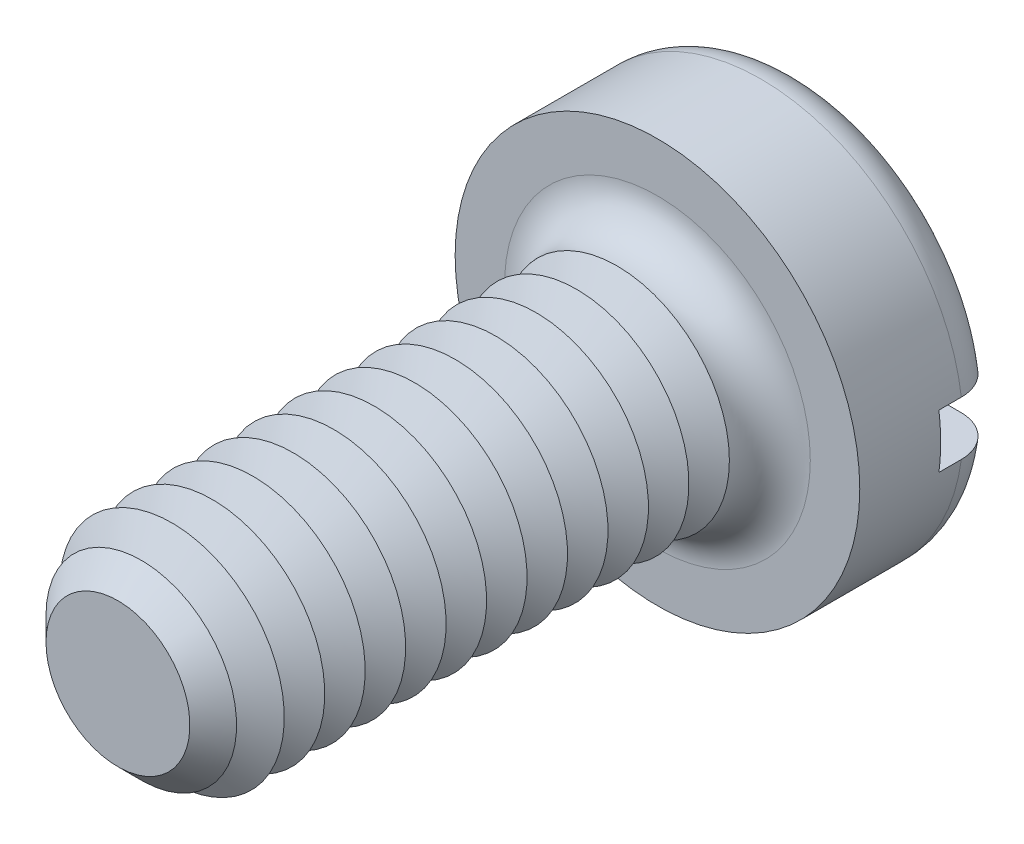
ISO-10303-21;
HEADER;
FILE_DESCRIPTION(('STEP AP214'),'2;1');
FILE_NAME('part.step','',(''),(''),'','','');
FILE_SCHEMA(('AUTOMOTIVE_DESIGN { 1 0 10303 214 1 1 1 1 }'));
ENDSEC;
DATA;
#1=APPLICATION_CONTEXT('core data for automotive mechanical design processes');
#2=APPLICATION_PROTOCOL_DEFINITION('international standard','automotive_design',2000,#1);
#3=PRODUCT_CONTEXT('',#1,'mechanical');
#4=PRODUCT('Part','Part','',(#3));
#5=PRODUCT_RELATED_PRODUCT_CATEGORY('part','',(#4));
#6=PRODUCT_DEFINITION_FORMATION('','',#4);
#7=PRODUCT_DEFINITION_CONTEXT('part definition',#1,'design');
#8=PRODUCT_DEFINITION('design','',#6,#7);
#9=PRODUCT_DEFINITION_SHAPE('','',#8);
#10=(LENGTH_UNIT() NAMED_UNIT(*) SI_UNIT(.MILLI.,.METRE.));
#11=(NAMED_UNIT(*) PLANE_ANGLE_UNIT() SI_UNIT($,.RADIAN.));
#12=(NAMED_UNIT(*) SI_UNIT($,.STERADIAN.) SOLID_ANGLE_UNIT());
#13=UNCERTAINTY_MEASURE_WITH_UNIT(LENGTH_MEASURE(1.E-05),#10,'distance_accuracy_value','');
#14=(GEOMETRIC_REPRESENTATION_CONTEXT(3) GLOBAL_UNCERTAINTY_ASSIGNED_CONTEXT((#13)) GLOBAL_UNIT_ASSIGNED_CONTEXT((#10,
#11,#12)) REPRESENTATION_CONTEXT('',''));
#15=CARTESIAN_POINT('',(0.,0.,0.));
#16=DIRECTION('',(0.,0.,1.));
#17=DIRECTION('',(1.,0.,0.));
#18=AXIS2_PLACEMENT_3D('',#15,#16,#17);
#19=CARTESIAN_POINT('',(0.,0.,-1.6));
#20=DIRECTION('',(0.,0.,1.));
#21=DIRECTION('',(1.,0.,0.));
#22=AXIS2_PLACEMENT_3D('',#19,#20,#21);
#23=PLANE('',#22);
#24=CARTESIAN_POINT('',(0.,0.,-1.6));
#25=DIRECTION('',(0.,0.,1.));
#26=DIRECTION('',(1.,0.,0.));
#27=AXIS2_PLACEMENT_3D('',#24,#25,#26);
#28=CIRCLE('',#27,1.8);
#29=CARTESIAN_POINT('',(-1.77482393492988,0.3,-1.6));
#30=VERTEX_POINT('',#29);
#31=CARTESIAN_POINT('',(1.77482393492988,0.3,-1.6));
#32=VERTEX_POINT('',#31);
#33=EDGE_CURVE('E116',#30,#32,#28,.F.);
#34=ORIENTED_EDGE('',*,*,#33,.T.);
#35=DIRECTION('',(1.,0.,0.));
#36=VECTOR('',#35,1.);
#37=CARTESIAN_POINT('',(-2.25,0.3,-1.6));
#38=LINE('',#37,#36);
#39=EDGE_CURVE('E111',#30,#32,#38,.T.);
#40=ORIENTED_EDGE('',*,*,#39,.F.);
#41=EDGE_LOOP('',(#34,#40));
#42=FACE_BOUND('',#41,.T.);
#43=ADVANCED_FACE('F39',(#42),#23,.F.);
#44=CARTESIAN_POINT('',(0.,0.,-1.15));
#45=DIRECTION('',(0.,0.,1.));
#46=DIRECTION('',(1.,0.,0.));
#47=AXIS2_PLACEMENT_3D('',#44,#45,#46);
#48=TOROIDAL_SURFACE('',#47,1.8,0.45);
#49=CARTESIAN_POINT('',(-2.09367249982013,0.3,-1.4713087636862));
#50=CARTESIAN_POINT('',(-2.07531034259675,0.3,-1.48912990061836));
#51=CARTESIAN_POINT('',(-2.05541605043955,0.3,-1.50540110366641));
#52=CARTESIAN_POINT('',(-2.01315405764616,0.3,-1.53437465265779));
#53=CARTESIAN_POINT('',(-1.99078310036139,0.3,-1.54707221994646));
#54=CARTESIAN_POINT('',(-1.94425163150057,0.3,-1.56853090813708));
#55=CARTESIAN_POINT('',(-1.92009286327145,0.3,-1.57729580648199));
#56=CARTESIAN_POINT('',(-1.8706617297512,0.3,-1.59068015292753));
#57=CARTESIAN_POINT('',(-1.84538964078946,0.3,-1.59530062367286));
#58=CARTESIAN_POINT('',(-1.7942134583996,0.3,-1.60031507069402));
#59=CARTESIAN_POINT('',(-1.76830582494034,0.3,-1.60067291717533));
#60=CARTESIAN_POINT('',(-1.71679040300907,0.3,-1.59707477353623));
#61=CARTESIAN_POINT('',(-1.69118264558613,0.3,-1.59311834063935));
#62=CARTESIAN_POINT('',(-1.64075792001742,0.3,-1.58095464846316));
#63=CARTESIAN_POINT('',(-1.61594989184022,0.3,-1.57271029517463));
#64=CARTESIAN_POINT('',(-1.56806655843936,0.3,-1.55217762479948));
#65=CARTESIAN_POINT('',(-1.54499130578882,0.3,-1.53988918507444));
#66=CARTESIAN_POINT('',(-1.50122413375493,0.3,-1.51158963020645));
#67=CARTESIAN_POINT('',(-1.48053389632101,0.3,-1.49557591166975));
#68=CARTESIAN_POINT('',(-1.44217532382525,0.3,-1.46026359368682));
#69=CARTESIAN_POINT('',(-1.42450683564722,0.3,-1.4409651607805));
#70=CARTESIAN_POINT('',(-1.39293961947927,0.3,-1.39986821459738));
#71=CARTESIAN_POINT('',(-1.37899788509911,0.3,-1.37810275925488));
#72=CARTESIAN_POINT('',(-1.35506190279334,0.3,-1.33249939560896));
#73=CARTESIAN_POINT('',(-1.34506709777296,0.3,-1.30866178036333));
#74=CARTESIAN_POINT('',(-1.3295415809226,0.3,-1.26015137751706));
#75=CARTESIAN_POINT('',(-1.32391771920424,0.3,-1.23550839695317));
#76=CARTESIAN_POINT('',(-1.31696995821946,0.3,-1.18562442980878));
#77=CARTESIAN_POINT('',(-1.31564552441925,0.3,-1.16038351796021));
#78=CARTESIAN_POINT('',(-1.31732714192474,0.3,-1.11049178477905));
#79=CARTESIAN_POINT('',(-1.32025766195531,0.3,-1.08583837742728));
#80=CARTESIAN_POINT('',(-1.3302124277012,0.3,-1.03737369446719));
#81=CARTESIAN_POINT('',(-1.33723664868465,0.3,-1.01356241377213));
#82=CARTESIAN_POINT('',(-1.35515820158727,0.3,-0.967413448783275));
#83=CARTESIAN_POINT('',(-1.36606032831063,0.3,-0.945077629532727));
#84=CARTESIAN_POINT('',(-1.39139351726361,0.3,-0.902507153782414));
#85=CARTESIAN_POINT('',(-1.40582489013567,0.3,-0.882272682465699));
#86=CARTESIAN_POINT('',(-1.43808691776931,0.3,-0.844072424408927));
#87=CARTESIAN_POINT('',(-1.4559757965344,0.3,-0.826155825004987));
#88=CARTESIAN_POINT('',(-1.49445205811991,0.3,-0.793502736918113));
#89=CARTESIAN_POINT('',(-1.51503974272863,0.3,-0.778766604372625));
#90=CARTESIAN_POINT('',(-1.55880475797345,0.3,-0.752571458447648));
#91=CARTESIAN_POINT('',(-1.58202794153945,0.3,-0.741189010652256));
#92=CARTESIAN_POINT('',(-1.63004083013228,0.3,-0.722432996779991));
#93=CARTESIAN_POINT('',(-1.65483064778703,0.3,-0.715059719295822));
#94=CARTESIAN_POINT('',(-1.70558060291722,0.3,-0.704463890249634));
#95=CARTESIAN_POINT('',(-1.73155090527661,0.3,-0.701289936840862));
#96=CARTESIAN_POINT('',(-1.78365633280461,0.3,-0.699350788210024));
#97=CARTESIAN_POINT('',(-1.80979145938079,0.3,-0.700585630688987));
#98=CARTESIAN_POINT('',(-1.86145503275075,0.3,-0.70744393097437));
#99=CARTESIAN_POINT('',(-1.88698403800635,0.3,-0.713063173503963));
#100=CARTESIAN_POINT('',(-1.93672112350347,0.3,-0.728546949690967));
#101=CARTESIAN_POINT('',(-1.96092925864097,0.3,-0.738411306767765));
#102=CARTESIAN_POINT('',(-2.00710191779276,0.3,-0.762015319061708));
#103=CARTESIAN_POINT('',(-2.02908465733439,0.3,-0.775719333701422));
#104=CARTESIAN_POINT('',(-2.0704025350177,0.3,-0.806663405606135));
#105=CARTESIAN_POINT('',(-2.08973782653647,0.3,-0.823903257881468));
#106=CARTESIAN_POINT('',(-2.12497879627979,0.3,-0.861218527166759));
#107=CARTESIAN_POINT('',(-2.1409209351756,0.3,-0.881259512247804));
#108=CARTESIAN_POINT('',(-2.16917502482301,0.3,-0.92375535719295));
#109=CARTESIAN_POINT('',(-2.18148717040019,0.3,-0.946210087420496));
#110=CARTESIAN_POINT('',(-2.20201023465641,0.3,-0.99266079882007));
#111=CARTESIAN_POINT('',(-2.21025973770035,0.3,-1.01663973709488));
#112=CARTESIAN_POINT('',(-2.22258852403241,0.3,-1.06564563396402));
#113=CARTESIAN_POINT('',(-2.22666813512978,0.3,-1.0906725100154));
#114=CARTESIAN_POINT('',(-2.23052418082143,0.3,-1.14090288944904));
#115=CARTESIAN_POINT('',(-2.23032644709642,0.3,-1.16610441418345));
#116=CARTESIAN_POINT('',(-2.22569614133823,0.3,-1.21612212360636));
#117=CARTESIAN_POINT('',(-2.2212625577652,0.3,-1.24093821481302));
#118=CARTESIAN_POINT('',(-2.20829785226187,0.3,-1.2894516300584));
#119=CARTESIAN_POINT('',(-2.19976997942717,0.3,-1.31314982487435));
#120=CARTESIAN_POINT('',(-2.17887390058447,0.3,-1.35876313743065));
#121=CARTESIAN_POINT('',(-2.1665103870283,0.3,-1.3806803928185));
#122=CARTESIAN_POINT('',(-2.14384463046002,0.3,-1.4140108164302));
#123=CARTESIAN_POINT('',(-2.13462949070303,0.3,-1.42617780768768));
#124=CARTESIAN_POINT('',(-2.1150151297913,0.3,-1.44951629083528));
#125=CARTESIAN_POINT('',(-2.10461591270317,0.3,-1.46068778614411));
#126=CARTESIAN_POINT('',(-2.09367249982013,0.3,-1.4713087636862));
#127=B_SPLINE_CURVE_WITH_KNOTS('',3,(#49,#50,#51,#52,#53,#54,#55,#56,#57,#58,#59,#60,#61,#62,
#63,#64,#65,#66,#67,#68,#69,#70,#71,#72,#73,#74,#75,#76,#77,#78,#79,#80,#81,#82,#83,#84,#85,#86,
#87,#88,#89,#90,#91,#92,#93,#94,#95,#96,#97,#98,#99,#100,#101,#102,#103,#104,#105,#106,#107,
#108,#109,#110,#111,#112,#113,#114,#115,#116,#117,#118,#119,#120,#121,#122,#123,#124,#125,#126),
.UNSPECIFIED.,.T.,.F.,(4,2,2,2,2,2,2,2,2,2,2,2,2,2,2,2,2,2,2,2,2,2,2,2,2,2,2,2,2,2,2,2,2,2,2,2,
2,2,4),(0.,0.0767085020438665,0.153519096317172,0.230255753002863,0.306973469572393,
0.384340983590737,0.461716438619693,0.539772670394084,0.617831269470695,0.695944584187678,
0.774053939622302,0.851218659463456,0.928372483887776,1.00383319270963,1.07928451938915,
1.15341274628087,1.22754052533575,1.30176027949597,1.37598656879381,1.45159320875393,
1.52720831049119,1.6044355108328,1.68166826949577,1.75978723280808,1.8379068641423,
1.91595148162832,1.99399285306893,2.07133254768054,2.14866775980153,2.22512456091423,
2.30157725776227,2.3772891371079,2.45299506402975,2.52824391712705,2.60351074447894,
2.67871794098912,2.75383349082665,2.79955010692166,2.84526656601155),.UNSPECIFIED.);
#128=CARTESIAN_POINT('',(-2.22991031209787,0.3,-1.14999999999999));
#129=VERTEX_POINT('',#128);
#130=EDGE_CURVE('E281',#129,#30,#127,.T.);
#131=ORIENTED_EDGE('',*,*,#130,.F.);
#132=CARTESIAN_POINT('',(0.,0.,-1.15));
#133=DIRECTION('',(0.,0.,1.));
#134=DIRECTION('',(1.,0.,0.));
#135=AXIS2_PLACEMENT_3D('',#132,#133,#134);
#136=CIRCLE('',#135,2.25);
#137=CARTESIAN_POINT('',(2.22991031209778,0.3,-1.15));
#138=VERTEX_POINT('',#137);
#139=EDGE_CURVE('E125',#138,#129,#136,.T.);
#140=ORIENTED_EDGE('',*,*,#139,.F.);
#141=CARTESIAN_POINT('',(1.39325818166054,0.3,-1.39903402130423));
#142=CARTESIAN_POINT('',(1.40771723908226,0.3,-1.42030595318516));
#143=CARTESIAN_POINT('',(1.4240122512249,0.3,-1.4403555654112));
#144=CARTESIAN_POINT('',(1.45976320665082,0.3,-1.4774406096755));
#145=CARTESIAN_POINT('',(1.47922380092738,0.3,-1.49447152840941));
#146=CARTESIAN_POINT('',(1.5206923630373,0.3,-1.52502510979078));
#147=CARTESIAN_POINT('',(1.54269721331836,0.3,-1.53855200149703));
#148=CARTESIAN_POINT('',(1.58863815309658,0.3,-1.56176272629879));
#149=CARTESIAN_POINT('',(1.61257369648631,0.3,-1.57144764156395));
#150=CARTESIAN_POINT('',(1.66199169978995,0.3,-1.58680804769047));
#151=CARTESIAN_POINT('',(1.68748839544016,0.3,-1.59243778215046));
#152=CARTESIAN_POINT('',(1.73906656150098,0.3,-1.59934902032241));
#153=CARTESIAN_POINT('',(1.76514807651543,0.3,-1.60063019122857));
#154=CARTESIAN_POINT('',(1.81721740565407,0.3,-1.59879130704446));
#155=CARTESIAN_POINT('',(1.84320486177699,0.3,-1.59566102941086));
#156=CARTESIAN_POINT('',(1.89427635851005,0.3,-1.58504931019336));
#157=CARTESIAN_POINT('',(1.91936042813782,0.3,-1.57756800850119));
#158=CARTESIAN_POINT('',(1.9677137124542,0.3,-1.55851722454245));
#159=CARTESIAN_POINT('',(1.99099484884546,0.3,-1.5469780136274));
#160=CARTESIAN_POINT('',(2.03525897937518,0.3,-1.52011224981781));
#161=CARTESIAN_POINT('',(2.05624211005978,0.3,-1.50478592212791));
#162=CARTESIAN_POINT('',(2.09506403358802,0.3,-1.47096472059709));
#163=CARTESIAN_POINT('',(2.11293536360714,0.3,-1.45250719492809));
#164=CARTESIAN_POINT('',(2.14528563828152,0.3,-1.41282609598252));
#165=CARTESIAN_POINT('',(2.15976477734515,0.3,-1.39160268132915));
#166=CARTESIAN_POINT('',(2.18476262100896,0.3,-1.34723254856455));
#167=CARTESIAN_POINT('',(2.19532119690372,0.3,-1.32410828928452));
#168=CARTESIAN_POINT('',(2.21237438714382,0.3,-1.27640693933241));
#169=CARTESIAN_POINT('',(2.21886918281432,0.3,-1.25182991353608));
#170=CARTESIAN_POINT('',(2.2275687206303,0.3,-1.20210937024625));
#171=CARTESIAN_POINT('',(2.22980376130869,0.3,-1.17697115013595));
#172=CARTESIAN_POINT('',(2.23000940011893,0.3,-1.12667754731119));
#173=CARTESIAN_POINT('',(2.22798009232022,0.3,-1.10152216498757));
#174=CARTESIAN_POINT('',(2.21972856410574,0.3,-1.05197773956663));
#175=CARTESIAN_POINT('',(2.21351744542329,0.3,-1.02758684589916));
#176=CARTESIAN_POINT('',(2.19709696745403,0.3,-0.980190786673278));
#177=CARTESIAN_POINT('',(2.18688760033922,0.3,-0.957185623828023));
#178=CARTESIAN_POINT('',(2.1627435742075,0.3,-0.913157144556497));
#179=CARTESIAN_POINT('',(2.14880093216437,0.3,-0.892138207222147));
#180=CARTESIAN_POINT('',(2.11760640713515,0.3,-0.852719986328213));
#181=CARTESIAN_POINT('',(2.10035443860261,0.3,-0.834320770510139));
#182=CARTESIAN_POINT('',(2.06291254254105,0.3,-0.80052923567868));
#183=CARTESIAN_POINT('',(2.04270386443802,0.3,-0.785157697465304));
#184=CARTESIAN_POINT('',(2.0000139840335,0.3,-0.757986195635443));
#185=CARTESIAN_POINT('',(1.97753267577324,0.3,-0.746186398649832));
#186=CARTESIAN_POINT('',(1.93069507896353,0.3,-0.726364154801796));
#187=CARTESIAN_POINT('',(1.90632219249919,0.3,-0.718380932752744));
#188=CARTESIAN_POINT('',(1.85658993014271,0.3,-0.706569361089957));
#189=CARTESIAN_POINT('',(1.83123049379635,0.3,-0.702741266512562));
#190=CARTESIAN_POINT('',(1.77994107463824,0.3,-0.699306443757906));
#191=CARTESIAN_POINT('',(1.75400788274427,0.3,-0.69974759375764));
#192=CARTESIAN_POINT('',(1.70257608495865,0.3,-0.704939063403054));
#193=CARTESIAN_POINT('',(1.67707750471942,0.3,-0.709689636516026));
#194=CARTESIAN_POINT('',(1.62701662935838,0.3,-0.723419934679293));
#195=CARTESIAN_POINT('',(1.60246387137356,0.3,-0.732434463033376));
#196=CARTESIAN_POINT('',(1.55521886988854,0.3,-0.754458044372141));
#197=CARTESIAN_POINT('',(1.53252668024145,0.3,-0.76746721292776));
#198=CARTESIAN_POINT('',(1.48966925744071,0.3,-0.797124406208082));
#199=CARTESIAN_POINT('',(1.46950315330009,0.3,-0.813771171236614));
#200=CARTESIAN_POINT('',(1.43229728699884,0.3,-0.850255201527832));
#201=CARTESIAN_POINT('',(1.41525734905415,0.3,-0.870092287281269));
#202=CARTESIAN_POINT('',(1.3850470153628,0.3,-0.912123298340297));
#203=CARTESIAN_POINT('',(1.37182821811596,0.3,-0.934282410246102));
#204=CARTESIAN_POINT('',(1.34939737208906,0.3,-0.980542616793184));
#205=CARTESIAN_POINT('',(1.34018456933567,0.3,-1.00464334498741));
#206=CARTESIAN_POINT('',(1.32624172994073,0.3,-1.05352472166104));
#207=CARTESIAN_POINT('',(1.32141599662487,0.3,-1.07827808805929));
#208=CARTESIAN_POINT('',(1.31606478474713,0.3,-1.12825155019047));
#209=CARTESIAN_POINT('',(1.31553992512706,0.3,-1.15347171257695));
#210=CARTESIAN_POINT('',(1.31878307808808,0.3,-1.20323022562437));
#211=CARTESIAN_POINT('',(1.32248353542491,0.3,-1.22777305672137));
#212=CARTESIAN_POINT('',(1.33394086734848,0.3,-1.27586981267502));
#213=CARTESIAN_POINT('',(1.34169274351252,0.3,-1.2994249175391));
#214=CARTESIAN_POINT('',(1.35704250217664,0.3,-1.33561898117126));
#215=CARTESIAN_POINT('',(1.36341395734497,0.3,-1.34879219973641));
#216=CARTESIAN_POINT('',(1.37741190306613,0.3,-1.37445328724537));
#217=CARTESIAN_POINT('',(1.38503837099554,0.3,-1.38694116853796));
#218=CARTESIAN_POINT('',(1.39325818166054,0.3,-1.39903402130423));
#219=B_SPLINE_CURVE_WITH_KNOTS('',3,(#141,#142,#143,#144,#145,#146,#147,#148,#149,#150,#151,
#152,#153,#154,#155,#156,#157,#158,#159,#160,#161,#162,#163,#164,#165,#166,#167,#168,#169,#170,
#171,#172,#173,#174,#175,#176,#177,#178,#179,#180,#181,#182,#183,#184,#185,#186,#187,#188,#189,
#190,#191,#192,#193,#194,#195,#196,#197,#198,#199,#200,#201,#202,#203,#204,#205,#206,#207,#208,
#209,#210,#211,#212,#213,#214,#215,#216,#217,#218),.UNSPECIFIED.,.T.,.F.,(4,2,2,2,2,2,2,2,2,2,2,
2,2,2,2,2,2,2,2,2,2,2,2,2,2,2,2,2,2,2,2,2,2,2,2,2,2,2,4),(0.,0.0771077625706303,
0.154329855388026,0.231458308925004,0.308565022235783,0.386528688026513,0.464498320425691,
0.542648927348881,0.620797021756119,0.698374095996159,0.77594655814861,0.852651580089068,
0.929352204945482,1.00524992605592,1.08114426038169,1.15649673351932,1.2318475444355,
1.30699910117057,1.38215080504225,1.45746451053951,1.53278016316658,1.60859599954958,
1.68441537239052,1.76099806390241,1.83758545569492,1.91503273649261,1.99248457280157,
2.07057979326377,2.14867727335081,2.22674775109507,2.30481383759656,2.38184276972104,
2.45885719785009,2.53414829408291,2.6094502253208,2.68356487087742,2.75758829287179,
2.80142397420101,2.84525886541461),.UNSPECIFIED.);
#220=EDGE_CURVE('E283',#32,#138,#219,.T.);
#221=ORIENTED_EDGE('',*,*,#220,.F.);
#222=ORIENTED_EDGE('',*,*,#33,.F.);
#223=EDGE_LOOP('',(#131,#140,#221,#222));
#224=FACE_BOUND('',#223,.T.);
#225=ADVANCED_FACE('F265',(#224),#48,.T.);
#226=CARTESIAN_POINT('',(0.,0.,-1.6));
#227=DIRECTION('',(0.,0.,1.));
#228=DIRECTION('',(1.,0.,0.));
#229=AXIS2_PLACEMENT_3D('',#226,#227,#228);
#230=CYLINDRICAL_SURFACE('',#229,2.25);
#231=DIRECTION('',(0.,0.,1.));
#232=VECTOR('',#231,1.);
#233=CARTESIAN_POINT('',(2.22991031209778,0.3,-1.6));
#234=LINE('',#233,#232);
#235=CARTESIAN_POINT('',(2.22991031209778,0.3,-0.9));
#236=VERTEX_POINT('',#235);
#237=EDGE_CURVE('E298',#138,#236,#234,.T.);
#238=ORIENTED_EDGE('',*,*,#237,.F.);
#239=ORIENTED_EDGE('',*,*,#139,.T.);
#240=DIRECTION('',(0.,0.,1.));
#241=VECTOR('',#240,1.);
#242=CARTESIAN_POINT('',(-2.22991031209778,0.3,-1.6));
#243=LINE('',#242,#241);
#244=CARTESIAN_POINT('',(-2.22991031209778,0.3,-0.9));
#245=VERTEX_POINT('',#244);
#246=EDGE_CURVE('E63',#245,#129,#243,.F.);
#247=ORIENTED_EDGE('',*,*,#246,.F.);
#248=CARTESIAN_POINT('',(0.,0.,-0.9));
#249=DIRECTION('',(0.,0.,-1.));
#250=DIRECTION('',(-1.,0.,0.));
#251=AXIS2_PLACEMENT_3D('',#248,#249,#250);
#252=CIRCLE('',#251,2.25);
#253=CARTESIAN_POINT('',(-2.22991031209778,-0.3,-0.9));
#254=VERTEX_POINT('',#253);
#255=EDGE_CURVE('E43',#245,#254,#252,.F.);
#256=ORIENTED_EDGE('',*,*,#255,.T.);
#257=DIRECTION('',(0.,0.,1.));
#258=VECTOR('',#257,1.);
#259=CARTESIAN_POINT('',(-2.22991031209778,-0.3,-1.6));
#260=LINE('',#259,#258);
#261=CARTESIAN_POINT('',(-2.22991031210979,-0.3,-1.15000000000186));
#262=VERTEX_POINT('',#261);
#263=EDGE_CURVE('E295',#262,#254,#260,.T.);
#264=ORIENTED_EDGE('',*,*,#263,.F.);
#265=CARTESIAN_POINT('',(2.22991031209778,-0.3,-1.15));
#266=VERTEX_POINT('',#265);
#267=EDGE_CURVE('E127',#262,#266,#136,.T.);
#268=ORIENTED_EDGE('',*,*,#267,.T.);
#269=DIRECTION('',(0.,0.,1.));
#270=VECTOR('',#269,1.);
#271=CARTESIAN_POINT('',(2.22991031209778,-0.3,-1.6));
#272=LINE('',#271,#270);
#273=CARTESIAN_POINT('',(2.22991031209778,-0.3,-0.9));
#274=VERTEX_POINT('',#273);
#275=EDGE_CURVE('E55',#274,#266,#272,.F.);
#276=ORIENTED_EDGE('',*,*,#275,.F.);
#277=EDGE_CURVE('E11',#274,#236,#252,.F.);
#278=ORIENTED_EDGE('',*,*,#277,.T.);
#279=EDGE_LOOP('',(#238,#239,#247,#256,#264,#268,#276,#278));
#280=FACE_BOUND('',#279,.T.);
#281=CARTESIAN_POINT('',(0.,0.,0.));
#282=DIRECTION('',(0.,0.,1.));
#283=DIRECTION('',(1.,0.,0.));
#284=AXIS2_PLACEMENT_3D('',#281,#282,#283);
#285=CIRCLE('',#284,2.25);
#286=CARTESIAN_POINT('',(2.25,0.,0.));
#287=VERTEX_POINT('',#286);
#288=EDGE_CURVE('E300',#287,#287,#285,.T.);
#289=ORIENTED_EDGE('',*,*,#288,.F.);
#290=EDGE_LOOP('',(#289));
#291=FACE_BOUND('',#290,.T.);
#292=ADVANCED_FACE('F261',(#280,#291),#230,.T.);
#293=CARTESIAN_POINT('',(1.77482393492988,-0.3,-1.6));
#294=VERTEX_POINT('',#293);
#295=CARTESIAN_POINT('',(-1.77482393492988,-0.3,-1.6));
#296=VERTEX_POINT('',#295);
#297=EDGE_CURVE('E109',#294,#296,#28,.F.);
#298=ORIENTED_EDGE('',*,*,#297,.T.);
#299=DIRECTION('',(-1.,0.,0.));
#300=VECTOR('',#299,1.);
#301=CARTESIAN_POINT('',(-2.25,-0.3,-1.6));
#302=LINE('',#301,#300);
#303=EDGE_CURVE('E96',#294,#296,#302,.T.);
#304=ORIENTED_EDGE('',*,*,#303,.F.);
#305=EDGE_LOOP('',(#298,#304));
#306=FACE_BOUND('',#305,.T.);
#307=ADVANCED_FACE('F108',(#306),#23,.F.);
#308=CARTESIAN_POINT('',(0.,0.,0.));
#309=DIRECTION('',(0.,0.,1.));
#310=DIRECTION('',(1.,0.,0.));
#311=AXIS2_PLACEMENT_3D('',#308,#309,#310);
#312=PLANE('',#311);
#313=CARTESIAN_POINT('',(0.,0.,0.));
#314=DIRECTION('',(0.,0.,1.));
#315=DIRECTION('',(1.,0.,0.));
#316=AXIS2_PLACEMENT_3D('',#313,#314,#315);
#317=CIRCLE('',#316,1.7);
#318=CARTESIAN_POINT('',(1.7,0.,0.));
#319=VERTEX_POINT('',#318);
#320=EDGE_CURVE('E115',#319,#319,#317,.F.);
#321=ORIENTED_EDGE('',*,*,#320,.T.);
#322=EDGE_LOOP('',(#321));
#323=FACE_BOUND('',#322,.T.);
#324=ORIENTED_EDGE('',*,*,#288,.T.);
#325=EDGE_LOOP('',(#324));
#326=FACE_BOUND('',#325,.T.);
#327=ADVANCED_FACE('F260',(#323,#326),#312,.T.);
#328=CARTESIAN_POINT('',(-2.09367249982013,-0.3,-1.4713087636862));
#329=CARTESIAN_POINT('',(-2.11176539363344,-0.3,-1.45374579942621));
#330=CARTESIAN_POINT('',(-2.1283968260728,-0.3,-1.43465254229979));
#331=CARTESIAN_POINT('',(-2.15823692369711,-0.3,-1.39393307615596));
#332=CARTESIAN_POINT('',(-2.17144184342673,-0.3,-1.37230413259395));
#333=CARTESIAN_POINT('',(-2.19402281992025,-0.3,-1.32713362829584));
#334=CARTESIAN_POINT('',(-2.20339951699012,-0.3,-1.30359238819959));
#335=CARTESIAN_POINT('',(-2.21804409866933,-0.3,-1.25527081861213));
#336=CARTESIAN_POINT('',(-2.22331295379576,-0.3,-1.23049078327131));
#337=CARTESIAN_POINT('',(-2.22957448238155,-0.3,-1.18050893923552));
#338=CARTESIAN_POINT('',(-2.23058617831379,-0.3,-1.15530951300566));
#339=CARTESIAN_POINT('',(-2.22835535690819,-0.3,-1.10509920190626));
#340=CARTESIAN_POINT('',(-2.22511277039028,-0.3,-1.08008832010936));
#341=CARTESIAN_POINT('',(-2.21448018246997,-0.3,-1.03101646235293));
#342=CARTESIAN_POINT('',(-2.20709836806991,-0.3,-1.00695371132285));
#343=CARTESIAN_POINT('',(-2.18841075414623,-0.3,-0.960404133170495));
#344=CARTESIAN_POINT('',(-2.17710493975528,-0.3,-0.937917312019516));
#345=CARTESIAN_POINT('',(-2.15086234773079,-0.3,-0.895085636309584));
#346=CARTESIAN_POINT('',(-2.13591537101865,-0.3,-0.874747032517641));
#347=CARTESIAN_POINT('',(-2.1028415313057,-0.3,-0.836845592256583));
#348=CARTESIAN_POINT('',(-2.08471458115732,-0.3,-0.819282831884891));
#349=CARTESIAN_POINT('',(-2.0456590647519,-0.3,-0.78729174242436));
#350=CARTESIAN_POINT('',(-2.0247112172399,-0.3,-0.772886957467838));
#351=CARTESIAN_POINT('',(-1.98071452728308,-0.3,-0.747756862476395));
#352=CARTESIAN_POINT('',(-1.95766557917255,-0.3,-0.737031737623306));
#353=CARTESIAN_POINT('',(-1.90986554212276,-0.3,-0.71944451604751));
#354=CARTESIAN_POINT('',(-1.88509923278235,-0.3,-0.712623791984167));
#355=CARTESIAN_POINT('',(-1.83477837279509,-0.3,-0.703186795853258));
#356=CARTESIAN_POINT('',(-1.80922377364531,-0.3,-0.700570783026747));
#357=CARTESIAN_POINT('',(-1.75774893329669,-0.3,-0.699591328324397));
#358=CARTESIAN_POINT('',(-1.73182778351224,-0.3,-0.701275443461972));
#359=CARTESIAN_POINT('',(-1.68062744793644,-0.3,-0.708937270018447));
#360=CARTESIAN_POINT('',(-1.65534829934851,-0.3,-0.714915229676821));
#361=CARTESIAN_POINT('',(-1.6059539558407,-0.3,-0.731056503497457));
#362=CARTESIAN_POINT('',(-1.58184881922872,-0.3,-0.741250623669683));
#363=CARTESIAN_POINT('',(-1.53569497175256,-0.3,-0.765548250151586));
#364=CARTESIAN_POINT('',(-1.51364629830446,-0.3,-0.779651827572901));
#365=CARTESIAN_POINT('',(-1.47229470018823,-0.3,-0.811355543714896));
#366=CARTESIAN_POINT('',(-1.45298625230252,-0.3,-0.828948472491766));
#367=CARTESIAN_POINT('',(-1.41765142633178,-0.3,-0.867170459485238));
#368=CARTESIAN_POINT('',(-1.40162480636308,-0.3,-0.887799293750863));
#369=CARTESIAN_POINT('',(-1.37358365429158,-0.3,-0.93118317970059));
#370=CARTESIAN_POINT('',(-1.3615121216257,-0.3,-0.953901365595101));
#371=CARTESIAN_POINT('',(-1.34145576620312,-0.3,-1.00107529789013));
#372=CARTESIAN_POINT('',(-1.33347032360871,-0.3,-1.02553078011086));
#373=CARTESIAN_POINT('',(-1.32199536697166,-0.3,-1.07489401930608));
#374=CARTESIAN_POINT('',(-1.31840873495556,-0.3,-1.09977921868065));
#375=CARTESIAN_POINT('',(-1.31553052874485,-0.3,-1.1497957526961));
#376=CARTESIAN_POINT('',(-1.31623852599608,-0.3,-1.17492706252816));
#377=CARTESIAN_POINT('',(-1.32188368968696,-0.3,-1.22435119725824));
#378=CARTESIAN_POINT('',(-1.32676151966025,-0.3,-1.24865083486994));
#379=CARTESIAN_POINT('',(-1.34050334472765,-0.3,-1.29609421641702));
#380=CARTESIAN_POINT('',(-1.34936742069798,-0.3,-1.31923793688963));
#381=CARTESIAN_POINT('',(-1.37086295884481,-0.3,-1.36387796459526));
#382=CARTESIAN_POINT('',(-1.38351729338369,-0.3,-1.38536324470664));
#383=CARTESIAN_POINT('',(-1.41218367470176,-0.3,-1.42596199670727));
#384=CARTESIAN_POINT('',(-1.42819606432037,-0.3,-1.44507522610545));
#385=CARTESIAN_POINT('',(-1.46347664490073,-0.3,-1.48081087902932));
#386=CARTESIAN_POINT('',(-1.48280543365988,-0.3,-1.49737347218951));
#387=CARTESIAN_POINT('',(-1.5239232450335,-0.3,-1.52709508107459));
#388=CARTESIAN_POINT('',(-1.54571253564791,-0.3,-1.54025372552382));
#389=CARTESIAN_POINT('',(-1.59160097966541,-0.3,-1.56305446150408));
#390=CARTESIAN_POINT('',(-1.61573734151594,-0.3,-1.57262172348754));
#391=CARTESIAN_POINT('',(-1.66526504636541,-0.3,-1.58760700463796));
#392=CARTESIAN_POINT('',(-1.69065641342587,-0.3,-1.59302494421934));
#393=CARTESIAN_POINT('',(-1.74220154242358,-0.3,-1.59958446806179));
#394=CARTESIAN_POINT('',(-1.7683598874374,-0.3,-1.60069012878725));
#395=CARTESIAN_POINT('',(-1.82049681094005,-0.3,-1.59847888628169));
#396=CARTESIAN_POINT('',(-1.8464753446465,-0.3,-1.59516091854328));
#397=CARTESIAN_POINT('',(-1.89742078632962,-0.3,-1.58419269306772));
#398=CARTESIAN_POINT('',(-1.92239041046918,-0.3,-1.57655503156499));
#399=CARTESIAN_POINT('',(-1.97064988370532,-0.3,-1.55715679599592));
#400=CARTESIAN_POINT('',(-1.99394179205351,-0.3,-1.54540138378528));
#401=CARTESIAN_POINT('',(-2.03003215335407,-0.3,-1.52312594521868));
#402=CARTESIAN_POINT('',(-2.04354254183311,-0.3,-1.51373809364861));
#403=CARTESIAN_POINT('',(-2.06946640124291,-0.3,-1.49355310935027));
#404=CARTESIAN_POINT('',(-2.08187987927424,-0.3,-1.48275598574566));
#405=CARTESIAN_POINT('',(-2.09367249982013,-0.3,-1.4713087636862));
#406=B_SPLINE_CURVE_WITH_KNOTS('',3,(#328,#329,#330,#331,#332,#333,#334,#335,#336,#337,#338,
#339,#340,#341,#342,#343,#344,#345,#346,#347,#348,#349,#350,#351,#352,#353,#354,#355,#356,#357,
#358,#359,#360,#361,#362,#363,#364,#365,#366,#367,#368,#369,#370,#371,#372,#373,#374,#375,#376,
#377,#378,#379,#380,#381,#382,#383,#384,#385,#386,#387,#388,#389,#390,#391,#392,#393,#394,#395,
#396,#397,#398,#399,#400,#401,#402,#403,#404,#405),.UNSPECIFIED.,.T.,.F.,(4,2,2,2,2,2,2,2,2,2,2,
2,2,2,2,2,2,2,2,2,2,2,2,2,2,2,2,2,2,2,2,2,2,2,2,2,2,2,4),(0.,0.0755864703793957,
0.151255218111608,0.226911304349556,0.302549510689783,0.377849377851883,0.453150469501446,
0.528303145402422,0.603456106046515,0.67882204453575,0.754190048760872,0.83010216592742,
0.906018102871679,0.982724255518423,1.05943513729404,1.13699806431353,1.21456547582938,
1.29270994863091,1.37085584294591,1.44884191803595,1.52682224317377,1.60362346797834,
1.68041303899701,1.75547480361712,1.83052907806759,1.90453278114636,1.97853798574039,
2.05299909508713,2.12746781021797,2.20347986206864,2.27950020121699,2.3570265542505,
2.43455439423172,2.5127267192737,2.59091785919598,2.66888216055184,2.74674907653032,
2.79601528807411,2.84528118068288),.UNSPECIFIED.);
#407=EDGE_CURVE('E103',#296,#262,#406,.T.);
#408=ORIENTED_EDGE('',*,*,#407,.F.);
#409=ORIENTED_EDGE('',*,*,#297,.F.);
#410=CARTESIAN_POINT('',(1.39325818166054,-0.3,-1.39903402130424));
#411=CARTESIAN_POINT('',(1.37924349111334,-0.3,-1.37841200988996));
#412=CARTESIAN_POINT('',(1.36693374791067,-0.3,-1.35661225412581));
#413=CARTESIAN_POINT('',(1.34612289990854,-0.3,-1.31124547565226));
#414=CARTESIAN_POINT('',(1.33762533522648,-0.3,-1.28767683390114));
#415=CARTESIAN_POINT('',(1.32472877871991,-0.3,-1.23943261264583));
#416=CARTESIAN_POINT('',(1.3203309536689,-0.3,-1.21475672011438));
#417=CARTESIAN_POINT('',(1.31579198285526,-0.3,-1.16502199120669));
#418=CARTESIAN_POINT('',(1.31564980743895,-0.3,-1.13996324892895));
#419=CARTESIAN_POINT('',(1.31960322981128,-0.3,-1.09044336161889));
#420=CARTESIAN_POINT('',(1.32365524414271,-0.3,-1.06597872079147));
#421=CARTESIAN_POINT('',(1.33579339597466,-0.3,-1.01807218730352));
#422=CARTESIAN_POINT('',(1.34387971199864,-0.3,-0.994630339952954));
#423=CARTESIAN_POINT('',(1.36386460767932,-0.3,-0.949319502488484));
#424=CARTESIAN_POINT('',(1.37577869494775,-0.3,-0.92745736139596));
#425=CARTESIAN_POINT('',(1.40303929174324,-0.3,-0.885990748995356));
#426=CARTESIAN_POINT('',(1.41838612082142,-0.3,-0.866386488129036));
#427=CARTESIAN_POINT('',(1.45239955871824,-0.3,-0.829572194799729));
#428=CARTESIAN_POINT('',(1.47112624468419,-0.3,-0.812417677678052));
#429=CARTESIAN_POINT('',(1.51114353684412,-0.3,-0.78141873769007));
#430=CARTESIAN_POINT('',(1.53243442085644,-0.3,-0.767574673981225));
#431=CARTESIAN_POINT('',(1.57744959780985,-0.3,-0.743302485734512));
#432=CARTESIAN_POINT('',(1.6012148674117,-0.3,-0.732950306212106));
#433=CARTESIAN_POINT('',(1.65013556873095,-0.3,-0.71633816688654));
#434=CARTESIAN_POINT('',(1.67529109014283,-0.3,-0.710078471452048));
#435=CARTESIAN_POINT('',(1.72654223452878,-0.3,-0.701786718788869));
#436=CARTESIAN_POINT('',(1.75264462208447,-0.3,-0.699796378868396));
#437=CARTESIAN_POINT('',(1.80481283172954,-0.3,-0.700236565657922));
#438=CARTESIAN_POINT('',(1.83087865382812,-0.3,-0.702667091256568));
#439=CARTESIAN_POINT('',(1.88216421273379,-0.3,-0.71188843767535));
#440=CARTESIAN_POINT('',(1.90738581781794,-0.3,-0.718668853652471));
#441=CARTESIAN_POINT('',(1.95631449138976,-0.3,-0.736408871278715));
#442=CARTESIAN_POINT('',(1.98002162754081,-0.3,-0.747368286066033));
#443=CARTESIAN_POINT('',(2.02500221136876,-0.3,-0.773046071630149));
#444=CARTESIAN_POINT('',(2.04629687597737,-0.3,-0.78772726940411));
#445=CARTESIAN_POINT('',(2.08608258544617,-0.3,-0.820494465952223));
#446=CARTESIAN_POINT('',(2.10457379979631,-0.3,-0.838580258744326));
#447=CARTESIAN_POINT('',(2.1380062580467,-0.3,-0.877422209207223));
#448=CARTESIAN_POINT('',(2.15298532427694,-0.3,-0.898145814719));
#449=CARTESIAN_POINT('',(2.17921311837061,-0.3,-0.941832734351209));
#450=CARTESIAN_POINT('',(2.19046204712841,-0.3,-0.964795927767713));
#451=CARTESIAN_POINT('',(2.20880507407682,-0.3,-1.01207981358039));
#452=CARTESIAN_POINT('',(2.2159367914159,-0.3,-1.0363859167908));
#453=CARTESIAN_POINT('',(2.22599386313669,-0.3,-1.08585317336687));
#454=CARTESIAN_POINT('',(2.22891936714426,-0.3,-1.11101429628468));
#455=CARTESIAN_POINT('',(2.23047255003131,-0.3,-1.16133395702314));
#456=CARTESIAN_POINT('',(2.22912306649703,-0.3,-1.18649179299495));
#457=CARTESIAN_POINT('',(2.22221641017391,-0.3,-1.236222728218));
#458=CARTESIAN_POINT('',(2.21665928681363,-0.3,-1.26079583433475));
#459=CARTESIAN_POINT('',(2.20150655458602,-0.3,-1.30864604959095));
#460=CARTESIAN_POINT('',(2.19191347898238,-0.3,-1.3319239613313));
#461=CARTESIAN_POINT('',(2.16897085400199,-0.3,-1.37654778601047));
#462=CARTESIAN_POINT('',(2.15562126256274,-0.3,-1.39789367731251));
#463=CARTESIAN_POINT('',(2.12549147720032,-0.3,-1.43814583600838));
#464=CARTESIAN_POINT('',(2.1086973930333,-0.3,-1.45704170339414));
#465=CARTESIAN_POINT('',(2.07219852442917,-0.3,-1.491773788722));
#466=CARTESIAN_POINT('',(2.0524936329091,-0.3,-1.50760989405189));
#467=CARTESIAN_POINT('',(2.01056127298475,-0.3,-1.53591667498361));
#468=CARTESIAN_POINT('',(1.98831430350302,-0.3,-1.54835845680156));
#469=CARTESIAN_POINT('',(1.94206418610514,-0.3,-1.5693763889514));
#470=CARTESIAN_POINT('',(1.91806093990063,-0.3,-1.57795232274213));
#471=CARTESIAN_POINT('',(1.86869953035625,-0.3,-1.5910955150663));
#472=CARTESIAN_POINT('',(1.84332941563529,-0.3,-1.59561788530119));
#473=CARTESIAN_POINT('',(1.7921914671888,-0.3,-1.60038767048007));
#474=CARTESIAN_POINT('',(1.76642362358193,-0.3,-1.60063497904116));
#475=CARTESIAN_POINT('',(1.71493241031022,-0.3,-1.59684388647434));
#476=CARTESIAN_POINT('',(1.6892123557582,-0.3,-1.59276040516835));
#477=CARTESIAN_POINT('',(1.63880694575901,-0.3,-1.58035661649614));
#478=CARTESIAN_POINT('',(1.61412189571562,-0.3,-1.5720350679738));
#479=CARTESIAN_POINT('',(1.56635013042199,-0.3,-1.55132424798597));
#480=CARTESIAN_POINT('',(1.54327365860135,-0.3,-1.53891136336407));
#481=CARTESIAN_POINT('',(1.49956705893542,-0.3,-1.51037484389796));
#482=CARTESIAN_POINT('',(1.478934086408,-0.3,-1.49425558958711));
#483=CARTESIAN_POINT('',(1.44732882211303,-0.3,-1.46489751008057));
#484=CARTESIAN_POINT('',(1.43548118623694,-0.3,-1.45258668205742));
#485=CARTESIAN_POINT('',(1.41324217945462,-0.3,-1.42671249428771));
#486=CARTESIAN_POINT('',(1.40285079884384,-0.3,-1.41314914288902));
#487=CARTESIAN_POINT('',(1.39325818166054,-0.3,-1.39903402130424));
#488=B_SPLINE_CURVE_WITH_KNOTS('',3,(#410,#411,#412,#413,#414,#415,#416,#417,#418,#419,#420,
#421,#422,#423,#424,#425,#426,#427,#428,#429,#430,#431,#432,#433,#434,#435,#436,#437,#438,#439,
#440,#441,#442,#443,#444,#445,#446,#447,#448,#449,#450,#451,#452,#453,#454,#455,#456,#457,#458,
#459,#460,#461,#462,#463,#464,#465,#466,#467,#468,#469,#470,#471,#472,#473,#474,#475,#476,#477,
#478,#479,#480,#481,#482,#483,#484,#485,#486,#487),.UNSPECIFIED.,.T.,.F.,(4,2,2,2,2,2,2,2,2,2,2,
2,2,2,2,2,2,2,2,2,2,2,2,2,2,2,2,2,2,2,2,2,2,2,2,2,2,2,4),(0.,0.0747398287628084,
0.149548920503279,0.224379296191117,0.29919156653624,0.373234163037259,0.447280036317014,
0.521629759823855,0.595986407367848,0.671825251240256,0.747672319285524,0.825076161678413,
0.902485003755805,0.980646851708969,1.05880868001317,1.13678424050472,1.21475631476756,
1.29197834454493,1.36919570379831,1.44553881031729,1.52187780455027,1.59750777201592,
1.67313504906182,1.74835899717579,1.82358206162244,1.89875798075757,1.97393474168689,
2.04942084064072,2.12490971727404,2.20102244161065,2.27713942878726,2.35408926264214,
2.43104101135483,2.50880170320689,2.58658518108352,2.66482568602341,2.74297419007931,
2.79413160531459,2.84528867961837),.UNSPECIFIED.);
#489=EDGE_CURVE('E92',#266,#294,#488,.T.);
#490=ORIENTED_EDGE('',*,*,#489,.F.);
#491=ORIENTED_EDGE('',*,*,#267,.F.);
#492=EDGE_LOOP('',(#408,#409,#490,#491));
#493=FACE_BOUND('',#492,.T.);
#494=ADVANCED_FACE('F113',(#493),#48,.T.);
#495=CARTESIAN_POINT('',(0.,0.,0.45));
#496=DIRECTION('',(0.,0.,1.));
#497=DIRECTION('',(1.,0.,0.));
#498=AXIS2_PLACEMENT_3D('',#495,#496,#497);
#499=TOROIDAL_SURFACE('',#498,1.7,0.45);
#500=ORIENTED_EDGE('',*,*,#320,.F.);
#501=EDGE_LOOP('',(#500));
#502=FACE_BOUND('',#501,.T.);
#503=CARTESIAN_POINT('',(0.,0.,0.45));
#504=DIRECTION('',(0.,0.,-1.));
#505=DIRECTION('',(-1.,0.,0.));
#506=AXIS2_PLACEMENT_3D('',#503,#504,#505);
#507=CIRCLE('',#506,1.25);
#508=CARTESIAN_POINT('',(-1.25,0.,0.45));
#509=VERTEX_POINT('',#508);
#510=EDGE_CURVE('E304',#509,#509,#507,.T.);
#511=ORIENTED_EDGE('',*,*,#510,.T.);
#512=EDGE_LOOP('',(#511));
#513=FACE_BOUND('',#512,.T.);
#514=ADVANCED_FACE('F253',(#502,#513),#499,.F.);
#515=CARTESIAN_POINT('',(0.,0.,0.675));
#516=DIRECTION('',(0.,0.,-1.));
#517=DIRECTION('',(-1.,0.,0.));
#518=AXIS2_PLACEMENT_3D('',#515,#516,#517);
#519=CONICAL_SURFACE('',#518,0.860288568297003,1.0471975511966);
#520=ORIENTED_EDGE('',*,*,#510,.F.);
#521=EDGE_LOOP('',(#520));
#522=FACE_BOUND('',#521,.T.);
#523=CARTESIAN_POINT('',(0.,0.,0.675));
#524=DIRECTION('',(0.,0.,-1.));
#525=DIRECTION('',(-1.,0.,0.));
#526=AXIS2_PLACEMENT_3D('',#523,#524,#525);
#527=CIRCLE('',#526,0.860288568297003);
#528=CARTESIAN_POINT('',(-0.860288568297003,0.,0.675));
#529=VERTEX_POINT('',#528);
#530=EDGE_CURVE('E310',#529,#529,#527,.T.);
#531=ORIENTED_EDGE('',*,*,#530,.T.);
#532=EDGE_LOOP('',(#531));
#533=FACE_BOUND('',#532,.T.);
#534=ADVANCED_FACE('F249',(#522,#533),#519,.T.);
#535=CARTESIAN_POINT('',(0.,0.,0.9));
#536=DIRECTION('',(0.,0.,1.));
#537=DIRECTION('',(1.,0.,0.));
#538=AXIS2_PLACEMENT_3D('',#535,#536,#537);
#539=CONICAL_SURFACE('',#538,1.25,1.0471975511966);
#540=ORIENTED_EDGE('',*,*,#530,.F.);
#541=EDGE_LOOP('',(#540));
#542=FACE_BOUND('',#541,.T.);
#543=CARTESIAN_POINT('',(0.,0.,0.9));
#544=DIRECTION('',(0.,0.,-1.));
#545=DIRECTION('',(-1.,0.,0.));
#546=AXIS2_PLACEMENT_3D('',#543,#544,#545);
#547=CIRCLE('',#546,1.25);
#548=CARTESIAN_POINT('',(-1.25,0.,0.9));
#549=VERTEX_POINT('',#548);
#550=EDGE_CURVE('E315',#549,#549,#547,.T.);
#551=ORIENTED_EDGE('',*,*,#550,.T.);
#552=EDGE_LOOP('',(#551));
#553=FACE_BOUND('',#552,.T.);
#554=ADVANCED_FACE('F245',(#542,#553),#539,.T.);
#555=CARTESIAN_POINT('',(0.,0.,1.125));
#556=DIRECTION('',(0.,0.,-1.));
#557=DIRECTION('',(-1.,0.,0.));
#558=AXIS2_PLACEMENT_3D('',#555,#556,#557);
#559=CONICAL_SURFACE('',#558,0.860288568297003,1.0471975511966);
#560=ORIENTED_EDGE('',*,*,#550,.F.);
#561=EDGE_LOOP('',(#560));
#562=FACE_BOUND('',#561,.T.);
#563=CARTESIAN_POINT('',(0.,0.,1.125));
#564=DIRECTION('',(0.,0.,-1.));
#565=DIRECTION('',(-1.,0.,0.));
#566=AXIS2_PLACEMENT_3D('',#563,#564,#565);
#567=CIRCLE('',#566,0.860288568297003);
#568=CARTESIAN_POINT('',(-0.860288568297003,0.,1.125));
#569=VERTEX_POINT('',#568);
#570=EDGE_CURVE('E319',#569,#569,#567,.T.);
#571=ORIENTED_EDGE('',*,*,#570,.T.);
#572=EDGE_LOOP('',(#571));
#573=FACE_BOUND('',#572,.T.);
#574=ADVANCED_FACE('F241',(#562,#573),#559,.T.);
#575=CARTESIAN_POINT('',(0.,0.,1.35));
#576=DIRECTION('',(0.,0.,1.));
#577=DIRECTION('',(1.,0.,0.));
#578=AXIS2_PLACEMENT_3D('',#575,#576,#577);
#579=CONICAL_SURFACE('',#578,1.25,1.0471975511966);
#580=ORIENTED_EDGE('',*,*,#570,.F.);
#581=EDGE_LOOP('',(#580));
#582=FACE_BOUND('',#581,.T.);
#583=CARTESIAN_POINT('',(0.,0.,1.35));
#584=DIRECTION('',(0.,0.,-1.));
#585=DIRECTION('',(-1.,0.,0.));
#586=AXIS2_PLACEMENT_3D('',#583,#584,#585);
#587=CIRCLE('',#586,1.25);
#588=CARTESIAN_POINT('',(-1.25,0.,1.35));
#589=VERTEX_POINT('',#588);
#590=EDGE_CURVE('E323',#589,#589,#587,.T.);
#591=ORIENTED_EDGE('',*,*,#590,.T.);
#592=EDGE_LOOP('',(#591));
#593=FACE_BOUND('',#592,.T.);
#594=ADVANCED_FACE('F237',(#582,#593),#579,.T.);
#595=CARTESIAN_POINT('',(0.,0.,1.575));
#596=DIRECTION('',(0.,0.,-1.));
#597=DIRECTION('',(-1.,0.,0.));
#598=AXIS2_PLACEMENT_3D('',#595,#596,#597);
#599=CONICAL_SURFACE('',#598,0.860288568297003,1.0471975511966);
#600=ORIENTED_EDGE('',*,*,#590,.F.);
#601=EDGE_LOOP('',(#600));
#602=FACE_BOUND('',#601,.T.);
#603=CARTESIAN_POINT('',(0.,0.,1.575));
#604=DIRECTION('',(0.,0.,-1.));
#605=DIRECTION('',(-1.,0.,0.));
#606=AXIS2_PLACEMENT_3D('',#603,#604,#605);
#607=CIRCLE('',#606,0.860288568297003);
#608=CARTESIAN_POINT('',(-0.860288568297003,0.,1.575));
#609=VERTEX_POINT('',#608);
#610=EDGE_CURVE('E327',#609,#609,#607,.T.);
#611=ORIENTED_EDGE('',*,*,#610,.T.);
#612=EDGE_LOOP('',(#611));
#613=FACE_BOUND('',#612,.T.);
#614=ADVANCED_FACE('F233',(#602,#613),#599,.T.);
#615=CARTESIAN_POINT('',(0.,0.,1.8));
#616=DIRECTION('',(0.,0.,1.));
#617=DIRECTION('',(1.,0.,0.));
#618=AXIS2_PLACEMENT_3D('',#615,#616,#617);
#619=CONICAL_SURFACE('',#618,1.25,1.0471975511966);
#620=ORIENTED_EDGE('',*,*,#610,.F.);
#621=EDGE_LOOP('',(#620));
#622=FACE_BOUND('',#621,.T.);
#623=CARTESIAN_POINT('',(0.,0.,1.8));
#624=DIRECTION('',(0.,0.,-1.));
#625=DIRECTION('',(-1.,0.,0.));
#626=AXIS2_PLACEMENT_3D('',#623,#624,#625);
#627=CIRCLE('',#626,1.25);
#628=CARTESIAN_POINT('',(-1.25,0.,1.8));
#629=VERTEX_POINT('',#628);
#630=EDGE_CURVE('E331',#629,#629,#627,.T.);
#631=ORIENTED_EDGE('',*,*,#630,.T.);
#632=EDGE_LOOP('',(#631));
#633=FACE_BOUND('',#632,.T.);
#634=ADVANCED_FACE('F229',(#622,#633),#619,.T.);
#635=CARTESIAN_POINT('',(0.,0.,2.025));
#636=DIRECTION('',(0.,0.,-1.));
#637=DIRECTION('',(-1.,0.,0.));
#638=AXIS2_PLACEMENT_3D('',#635,#636,#637);
#639=CONICAL_SURFACE('',#638,0.860288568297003,1.0471975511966);
#640=ORIENTED_EDGE('',*,*,#630,.F.);
#641=EDGE_LOOP('',(#640));
#642=FACE_BOUND('',#641,.T.);
#643=CARTESIAN_POINT('',(0.,0.,2.025));
#644=DIRECTION('',(0.,0.,-1.));
#645=DIRECTION('',(-1.,0.,0.));
#646=AXIS2_PLACEMENT_3D('',#643,#644,#645);
#647=CIRCLE('',#646,0.860288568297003);
#648=CARTESIAN_POINT('',(-0.860288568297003,0.,2.025));
#649=VERTEX_POINT('',#648);
#650=EDGE_CURVE('E335',#649,#649,#647,.T.);
#651=ORIENTED_EDGE('',*,*,#650,.T.);
#652=EDGE_LOOP('',(#651));
#653=FACE_BOUND('',#652,.T.);
#654=ADVANCED_FACE('F225',(#642,#653),#639,.T.);
#655=CARTESIAN_POINT('',(0.,0.,2.25));
#656=DIRECTION('',(0.,0.,1.));
#657=DIRECTION('',(1.,0.,0.));
#658=AXIS2_PLACEMENT_3D('',#655,#656,#657);
#659=CONICAL_SURFACE('',#658,1.25,1.0471975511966);
#660=ORIENTED_EDGE('',*,*,#650,.F.);
#661=EDGE_LOOP('',(#660));
#662=FACE_BOUND('',#661,.T.);
#663=CARTESIAN_POINT('',(0.,0.,2.25));
#664=DIRECTION('',(0.,0.,-1.));
#665=DIRECTION('',(-1.,0.,0.));
#666=AXIS2_PLACEMENT_3D('',#663,#664,#665);
#667=CIRCLE('',#666,1.25);
#668=CARTESIAN_POINT('',(-1.25,0.,2.25));
#669=VERTEX_POINT('',#668);
#670=EDGE_CURVE('E339',#669,#669,#667,.T.);
#671=ORIENTED_EDGE('',*,*,#670,.T.);
#672=EDGE_LOOP('',(#671));
#673=FACE_BOUND('',#672,.T.);
#674=ADVANCED_FACE('F221',(#662,#673),#659,.T.);
#675=CARTESIAN_POINT('',(0.,0.,2.475));
#676=DIRECTION('',(0.,0.,-1.));
#677=DIRECTION('',(-1.,0.,0.));
#678=AXIS2_PLACEMENT_3D('',#675,#676,#677);
#679=CONICAL_SURFACE('',#678,0.860288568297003,1.0471975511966);
#680=ORIENTED_EDGE('',*,*,#670,.F.);
#681=EDGE_LOOP('',(#680));
#682=FACE_BOUND('',#681,.T.);
#683=CARTESIAN_POINT('',(0.,0.,2.475));
#684=DIRECTION('',(0.,0.,-1.));
#685=DIRECTION('',(-1.,0.,0.));
#686=AXIS2_PLACEMENT_3D('',#683,#684,#685);
#687=CIRCLE('',#686,0.860288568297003);
#688=CARTESIAN_POINT('',(-0.860288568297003,0.,2.475));
#689=VERTEX_POINT('',#688);
#690=EDGE_CURVE('E343',#689,#689,#687,.T.);
#691=ORIENTED_EDGE('',*,*,#690,.T.);
#692=EDGE_LOOP('',(#691));
#693=FACE_BOUND('',#692,.T.);
#694=ADVANCED_FACE('F217',(#682,#693),#679,.T.);
#695=CARTESIAN_POINT('',(0.,0.,2.7));
#696=DIRECTION('',(0.,0.,1.));
#697=DIRECTION('',(1.,0.,0.));
#698=AXIS2_PLACEMENT_3D('',#695,#696,#697);
#699=CONICAL_SURFACE('',#698,1.25,1.0471975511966);
#700=ORIENTED_EDGE('',*,*,#690,.F.);
#701=EDGE_LOOP('',(#700));
#702=FACE_BOUND('',#701,.T.);
#703=CARTESIAN_POINT('',(0.,0.,2.7));
#704=DIRECTION('',(0.,0.,-1.));
#705=DIRECTION('',(-1.,0.,0.));
#706=AXIS2_PLACEMENT_3D('',#703,#704,#705);
#707=CIRCLE('',#706,1.25);
#708=CARTESIAN_POINT('',(-1.25,0.,2.7));
#709=VERTEX_POINT('',#708);
#710=EDGE_CURVE('E347',#709,#709,#707,.T.);
#711=ORIENTED_EDGE('',*,*,#710,.T.);
#712=EDGE_LOOP('',(#711));
#713=FACE_BOUND('',#712,.T.);
#714=ADVANCED_FACE('F213',(#702,#713),#699,.T.);
#715=CARTESIAN_POINT('',(0.,0.,2.925));
#716=DIRECTION('',(0.,0.,-1.));
#717=DIRECTION('',(-1.,0.,0.));
#718=AXIS2_PLACEMENT_3D('',#715,#716,#717);
#719=CONICAL_SURFACE('',#718,0.860288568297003,1.0471975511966);
#720=ORIENTED_EDGE('',*,*,#710,.F.);
#721=EDGE_LOOP('',(#720));
#722=FACE_BOUND('',#721,.T.);
#723=CARTESIAN_POINT('',(0.,0.,2.925));
#724=DIRECTION('',(0.,0.,-1.));
#725=DIRECTION('',(-1.,0.,0.));
#726=AXIS2_PLACEMENT_3D('',#723,#724,#725);
#727=CIRCLE('',#726,0.860288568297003);
#728=CARTESIAN_POINT('',(-0.860288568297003,0.,2.925));
#729=VERTEX_POINT('',#728);
#730=EDGE_CURVE('E351',#729,#729,#727,.T.);
#731=ORIENTED_EDGE('',*,*,#730,.T.);
#732=EDGE_LOOP('',(#731));
#733=FACE_BOUND('',#732,.T.);
#734=ADVANCED_FACE('F209',(#722,#733),#719,.T.);
#735=CARTESIAN_POINT('',(0.,0.,3.15));
#736=DIRECTION('',(0.,0.,1.));
#737=DIRECTION('',(1.,0.,0.));
#738=AXIS2_PLACEMENT_3D('',#735,#736,#737);
#739=CONICAL_SURFACE('',#738,1.25,1.0471975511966);
#740=ORIENTED_EDGE('',*,*,#730,.F.);
#741=EDGE_LOOP('',(#740));
#742=FACE_BOUND('',#741,.T.);
#743=CARTESIAN_POINT('',(0.,0.,3.15));
#744=DIRECTION('',(0.,0.,-1.));
#745=DIRECTION('',(-1.,0.,0.));
#746=AXIS2_PLACEMENT_3D('',#743,#744,#745);
#747=CIRCLE('',#746,1.25);
#748=CARTESIAN_POINT('',(-1.25,0.,3.15));
#749=VERTEX_POINT('',#748);
#750=EDGE_CURVE('E355',#749,#749,#747,.T.);
#751=ORIENTED_EDGE('',*,*,#750,.T.);
#752=EDGE_LOOP('',(#751));
#753=FACE_BOUND('',#752,.T.);
#754=ADVANCED_FACE('F205',(#742,#753),#739,.T.);
#755=CARTESIAN_POINT('',(0.,0.,3.375));
#756=DIRECTION('',(0.,0.,-1.));
#757=DIRECTION('',(-1.,0.,0.));
#758=AXIS2_PLACEMENT_3D('',#755,#756,#757);
#759=CONICAL_SURFACE('',#758,0.860288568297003,1.0471975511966);
#760=ORIENTED_EDGE('',*,*,#750,.F.);
#761=EDGE_LOOP('',(#760));
#762=FACE_BOUND('',#761,.T.);
#763=CARTESIAN_POINT('',(0.,0.,3.375));
#764=DIRECTION('',(0.,0.,-1.));
#765=DIRECTION('',(-1.,0.,0.));
#766=AXIS2_PLACEMENT_3D('',#763,#764,#765);
#767=CIRCLE('',#766,0.860288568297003);
#768=CARTESIAN_POINT('',(-0.860288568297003,0.,3.375));
#769=VERTEX_POINT('',#768);
#770=EDGE_CURVE('E359',#769,#769,#767,.T.);
#771=ORIENTED_EDGE('',*,*,#770,.T.);
#772=EDGE_LOOP('',(#771));
#773=FACE_BOUND('',#772,.T.);
#774=ADVANCED_FACE('F201',(#762,#773),#759,.T.);
#775=CARTESIAN_POINT('',(0.,0.,3.6));
#776=DIRECTION('',(0.,0.,1.));
#777=DIRECTION('',(1.,0.,0.));
#778=AXIS2_PLACEMENT_3D('',#775,#776,#777);
#779=CONICAL_SURFACE('',#778,1.25,1.0471975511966);
#780=ORIENTED_EDGE('',*,*,#770,.F.);
#781=EDGE_LOOP('',(#780));
#782=FACE_BOUND('',#781,.T.);
#783=CARTESIAN_POINT('',(0.,0.,3.6));
#784=DIRECTION('',(0.,0.,-1.));
#785=DIRECTION('',(-1.,0.,0.));
#786=AXIS2_PLACEMENT_3D('',#783,#784,#785);
#787=CIRCLE('',#786,1.25);
#788=CARTESIAN_POINT('',(-1.25,0.,3.6));
#789=VERTEX_POINT('',#788);
#790=EDGE_CURVE('E363',#789,#789,#787,.T.);
#791=ORIENTED_EDGE('',*,*,#790,.T.);
#792=EDGE_LOOP('',(#791));
#793=FACE_BOUND('',#792,.T.);
#794=ADVANCED_FACE('F197',(#782,#793),#779,.T.);
#795=CARTESIAN_POINT('',(0.,0.,3.825));
#796=DIRECTION('',(0.,0.,-1.));
#797=DIRECTION('',(-1.,0.,0.));
#798=AXIS2_PLACEMENT_3D('',#795,#796,#797);
#799=CONICAL_SURFACE('',#798,0.860288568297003,1.0471975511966);
#800=ORIENTED_EDGE('',*,*,#790,.F.);
#801=EDGE_LOOP('',(#800));
#802=FACE_BOUND('',#801,.T.);
#803=CARTESIAN_POINT('',(0.,0.,3.825));
#804=DIRECTION('',(0.,0.,-1.));
#805=DIRECTION('',(-1.,0.,0.));
#806=AXIS2_PLACEMENT_3D('',#803,#804,#805);
#807=CIRCLE('',#806,0.860288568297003);
#808=CARTESIAN_POINT('',(-0.860288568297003,0.,3.825));
#809=VERTEX_POINT('',#808);
#810=EDGE_CURVE('E366',#809,#809,#807,.T.);
#811=ORIENTED_EDGE('',*,*,#810,.T.);
#812=EDGE_LOOP('',(#811));
#813=FACE_BOUND('',#812,.T.);
#814=ADVANCED_FACE('F193',(#802,#813),#799,.T.);
#815=CARTESIAN_POINT('',(0.,0.,4.05));
#816=DIRECTION('',(0.,0.,1.));
#817=DIRECTION('',(1.,0.,0.));
#818=AXIS2_PLACEMENT_3D('',#815,#816,#817);
#819=CONICAL_SURFACE('',#818,1.25,1.0471975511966);
#820=ORIENTED_EDGE('',*,*,#810,.F.);
#821=EDGE_LOOP('',(#820));
#822=FACE_BOUND('',#821,.T.);
#823=CARTESIAN_POINT('',(0.,0.,4.05));
#824=DIRECTION('',(0.,0.,-1.));
#825=DIRECTION('',(-1.,0.,0.));
#826=AXIS2_PLACEMENT_3D('',#823,#824,#825);
#827=CIRCLE('',#826,1.25);
#828=CARTESIAN_POINT('',(-1.25,0.,4.05));
#829=VERTEX_POINT('',#828);
#830=EDGE_CURVE('E370',#829,#829,#827,.T.);
#831=ORIENTED_EDGE('',*,*,#830,.T.);
#832=EDGE_LOOP('',(#831));
#833=FACE_BOUND('',#832,.T.);
#834=ADVANCED_FACE('F189',(#822,#833),#819,.T.);
#835=CARTESIAN_POINT('',(0.,0.,4.275));
#836=DIRECTION('',(0.,0.,-1.));
#837=DIRECTION('',(-1.,0.,0.));
#838=AXIS2_PLACEMENT_3D('',#835,#836,#837);
#839=CONICAL_SURFACE('',#838,0.860288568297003,1.0471975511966);
#840=ORIENTED_EDGE('',*,*,#830,.F.);
#841=EDGE_LOOP('',(#840));
#842=FACE_BOUND('',#841,.T.);
#843=CARTESIAN_POINT('',(0.,0.,4.275));
#844=DIRECTION('',(0.,0.,-1.));
#845=DIRECTION('',(-1.,0.,0.));
#846=AXIS2_PLACEMENT_3D('',#843,#844,#845);
#847=CIRCLE('',#846,0.860288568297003);
#848=CARTESIAN_POINT('',(-0.860288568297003,0.,4.275));
#849=VERTEX_POINT('',#848);
#850=EDGE_CURVE('E374',#849,#849,#847,.T.);
#851=ORIENTED_EDGE('',*,*,#850,.T.);
#852=EDGE_LOOP('',(#851));
#853=FACE_BOUND('',#852,.T.);
#854=ADVANCED_FACE('F185',(#842,#853),#839,.T.);
#855=CARTESIAN_POINT('',(0.,0.,4.5));
#856=DIRECTION('',(0.,0.,1.));
#857=DIRECTION('',(1.,0.,0.));
#858=AXIS2_PLACEMENT_3D('',#855,#856,#857);
#859=CONICAL_SURFACE('',#858,1.25,1.0471975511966);
#860=ORIENTED_EDGE('',*,*,#850,.F.);
#861=EDGE_LOOP('',(#860));
#862=FACE_BOUND('',#861,.T.);
#863=CARTESIAN_POINT('',(0.,0.,4.5));
#864=DIRECTION('',(0.,0.,-1.));
#865=DIRECTION('',(-1.,0.,0.));
#866=AXIS2_PLACEMENT_3D('',#863,#864,#865);
#867=CIRCLE('',#866,1.25);
#868=CARTESIAN_POINT('',(-1.25,0.,4.5));
#869=VERTEX_POINT('',#868);
#870=EDGE_CURVE('E378',#869,#869,#867,.T.);
#871=ORIENTED_EDGE('',*,*,#870,.T.);
#872=EDGE_LOOP('',(#871));
#873=FACE_BOUND('',#872,.T.);
#874=ADVANCED_FACE('F181',(#862,#873),#859,.T.);
#875=CARTESIAN_POINT('',(0.,0.,4.725));
#876=DIRECTION('',(0.,0.,-1.));
#877=DIRECTION('',(-1.,0.,0.));
#878=AXIS2_PLACEMENT_3D('',#875,#876,#877);
#879=CONICAL_SURFACE('',#878,0.860288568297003,1.0471975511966);
#880=ORIENTED_EDGE('',*,*,#870,.F.);
#881=EDGE_LOOP('',(#880));
#882=FACE_BOUND('',#881,.T.);
#883=CARTESIAN_POINT('',(0.,0.,4.725));
#884=DIRECTION('',(0.,0.,-1.));
#885=DIRECTION('',(-1.,0.,0.));
#886=AXIS2_PLACEMENT_3D('',#883,#884,#885);
#887=CIRCLE('',#886,0.860288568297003);
#888=CARTESIAN_POINT('',(-0.860288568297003,0.,4.725));
#889=VERTEX_POINT('',#888);
#890=EDGE_CURVE('E382',#889,#889,#887,.T.);
#891=ORIENTED_EDGE('',*,*,#890,.T.);
#892=EDGE_LOOP('',(#891));
#893=FACE_BOUND('',#892,.T.);
#894=ADVANCED_FACE('F177',(#882,#893),#879,.T.);
#895=CARTESIAN_POINT('',(0.,0.,4.95));
#896=DIRECTION('',(0.,0.,1.));
#897=DIRECTION('',(1.,0.,0.));
#898=AXIS2_PLACEMENT_3D('',#895,#896,#897);
#899=CONICAL_SURFACE('',#898,1.25,1.0471975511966);
#900=ORIENTED_EDGE('',*,*,#890,.F.);
#901=EDGE_LOOP('',(#900));
#902=FACE_BOUND('',#901,.T.);
#903=CARTESIAN_POINT('',(0.,0.,4.95));
#904=DIRECTION('',(0.,0.,-1.));
#905=DIRECTION('',(-1.,0.,0.));
#906=AXIS2_PLACEMENT_3D('',#903,#904,#905);
#907=CIRCLE('',#906,1.25);
#908=CARTESIAN_POINT('',(-1.25,0.,4.95));
#909=VERTEX_POINT('',#908);
#910=EDGE_CURVE('E386',#909,#909,#907,.T.);
#911=ORIENTED_EDGE('',*,*,#910,.T.);
#912=EDGE_LOOP('',(#911));
#913=FACE_BOUND('',#912,.T.);
#914=ADVANCED_FACE('F173',(#902,#913),#899,.T.);
#915=CARTESIAN_POINT('',(0.,0.,5.175));
#916=DIRECTION('',(0.,0.,-1.));
#917=DIRECTION('',(-1.,0.,0.));
#918=AXIS2_PLACEMENT_3D('',#915,#916,#917);
#919=CONICAL_SURFACE('',#918,0.860288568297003,1.0471975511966);
#920=ORIENTED_EDGE('',*,*,#910,.F.);
#921=EDGE_LOOP('',(#920));
#922=FACE_BOUND('',#921,.T.);
#923=CARTESIAN_POINT('',(0.,0.,5.175));
#924=DIRECTION('',(0.,0.,-1.));
#925=DIRECTION('',(-1.,0.,0.));
#926=AXIS2_PLACEMENT_3D('',#923,#924,#925);
#927=CIRCLE('',#926,0.860288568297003);
#928=CARTESIAN_POINT('',(-0.860288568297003,0.,5.175));
#929=VERTEX_POINT('',#928);
#930=EDGE_CURVE('E136',#929,#929,#927,.T.);
#931=ORIENTED_EDGE('',*,*,#930,.T.);
#932=EDGE_LOOP('',(#931));
#933=FACE_BOUND('',#932,.T.);
#934=ADVANCED_FACE('F169',(#922,#933),#919,.T.);
#935=CARTESIAN_POINT('',(0.,0.,5.4));
#936=DIRECTION('',(0.,0.,1.));
#937=DIRECTION('',(1.,0.,0.));
#938=AXIS2_PLACEMENT_3D('',#935,#936,#937);
#939=CONICAL_SURFACE('',#938,1.25,1.0471975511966);
#940=ORIENTED_EDGE('',*,*,#930,.F.);
#941=EDGE_LOOP('',(#940));
#942=FACE_BOUND('',#941,.T.);
#943=CARTESIAN_POINT('',(0.,0.,5.4));
#944=DIRECTION('',(0.,0.,-1.));
#945=DIRECTION('',(-1.,0.,0.));
#946=AXIS2_PLACEMENT_3D('',#943,#944,#945);
#947=CIRCLE('',#946,1.25);
#948=CARTESIAN_POINT('',(-1.25,0.,5.4));
#949=VERTEX_POINT('',#948);
#950=EDGE_CURVE('E137',#949,#949,#947,.T.);
#951=ORIENTED_EDGE('',*,*,#950,.T.);
#952=EDGE_LOOP('',(#951));
#953=FACE_BOUND('',#952,.T.);
#954=ADVANCED_FACE('F165',(#942,#953),#939,.T.);
#955=CARTESIAN_POINT('',(0.,0.,5.625));
#956=DIRECTION('',(0.,0.,-1.));
#957=DIRECTION('',(-1.,0.,0.));
#958=AXIS2_PLACEMENT_3D('',#955,#956,#957);
#959=CONICAL_SURFACE('',#958,0.860288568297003,1.0471975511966);
#960=ORIENTED_EDGE('',*,*,#950,.F.);
#961=EDGE_LOOP('',(#960));
#962=FACE_BOUND('',#961,.T.);
#963=CARTESIAN_POINT('',(0.,0.,5.625));
#964=DIRECTION('',(0.,0.,-1.));
#965=DIRECTION('',(-1.,0.,0.));
#966=AXIS2_PLACEMENT_3D('',#963,#964,#965);
#967=CIRCLE('',#966,0.860288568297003);
#968=CARTESIAN_POINT('',(-0.860288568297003,0.,5.625));
#969=VERTEX_POINT('',#968);
#970=EDGE_CURVE('E396',#969,#969,#967,.T.);
#971=ORIENTED_EDGE('',*,*,#970,.T.);
#972=EDGE_LOOP('',(#971));
#973=FACE_BOUND('',#972,.T.);
#974=ADVANCED_FACE('F161',(#962,#973),#959,.T.);
#975=CARTESIAN_POINT('',(0.,0.,5.85));
#976=DIRECTION('',(0.,0.,1.));
#977=DIRECTION('',(1.,0.,0.));
#978=AXIS2_PLACEMENT_3D('',#975,#976,#977);
#979=CONICAL_SURFACE('',#978,1.25,1.0471975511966);
#980=CARTESIAN_POINT('',(0.,0.,5.74019237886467));
#981=DIRECTION('',(0.,0.,1.));
#982=DIRECTION('',(1.,0.,0.));
#983=AXIS2_PLACEMENT_3D('',#980,#981,#982);
#984=CIRCLE('',#983,1.05980762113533);
#985=CARTESIAN_POINT('',(-1.05980762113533,0.,5.74019237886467));
#986=VERTEX_POINT('',#985);
#987=EDGE_CURVE('E133',#986,#986,#984,.F.);
#988=ORIENTED_EDGE('',*,*,#987,.T.);
#989=EDGE_LOOP('',(#988));
#990=FACE_BOUND('',#989,.T.);
#991=ORIENTED_EDGE('',*,*,#970,.F.);
#992=EDGE_LOOP('',(#991));
#993=FACE_BOUND('',#992,.T.);
#994=ADVANCED_FACE('F156',(#990,#993),#979,.T.);
#995=CARTESIAN_POINT('',(0.,0.,6.));
#996=DIRECTION('',(0.,0.,1.));
#997=DIRECTION('',(1.,0.,0.));
#998=AXIS2_PLACEMENT_3D('',#995,#996,#997);
#999=PLANE('',#998);
#1000=CARTESIAN_POINT('',(0.,0.,6.));
#1001=DIRECTION('',(0.,0.,1.));
#1002=DIRECTION('',(1.,0.,0.));
#1003=AXIS2_PLACEMENT_3D('',#1000,#1001,#1002);
#1004=CIRCLE('',#1003,0.799999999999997);
#1005=CARTESIAN_POINT('',(-0.799999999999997,0.,6.));
#1006=VERTEX_POINT('',#1005);
#1007=EDGE_CURVE('E104',#1006,#1006,#1004,.T.);
#1008=ORIENTED_EDGE('',*,*,#1007,.T.);
#1009=EDGE_LOOP('',(#1008));
#1010=FACE_BOUND('',#1009,.T.);
#1011=ADVANCED_FACE('F160',(#1010),#999,.T.);
#1012=CARTESIAN_POINT('',(0.,0.,6.));
#1013=DIRECTION('',(0.,0.,-1.));
#1014=DIRECTION('',(-1.,0.,0.));
#1015=AXIS2_PLACEMENT_3D('',#1012,#1013,#1014);
#1016=CONICAL_SURFACE('',#1015,0.799999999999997,0.785398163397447);
#1017=CARTESIAN_POINT('',(-1.05980762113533,0.,5.74019237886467));
#1018=CARTESIAN_POINT('',(-1.0571012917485,0.,5.74289870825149));
#1019=CARTESIAN_POINT('',(-1.05439496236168,0.,5.74560503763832));
#1020=CARTESIAN_POINT('',(-1.04898230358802,0.,5.75101769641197));
#1021=CARTESIAN_POINT('',(-1.0462759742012,0.,5.7537240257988));
#1022=CARTESIAN_POINT('',(-1.04086331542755,0.,5.75913668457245));
#1023=CARTESIAN_POINT('',(-1.03815698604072,0.,5.76184301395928));
#1024=CARTESIAN_POINT('',(-1.03274432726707,0.,5.76725567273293));
#1025=CARTESIAN_POINT('',(-1.03003799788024,0.,5.76996200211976));
#1026=CARTESIAN_POINT('',(-1.02462533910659,0.,5.77537466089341));
#1027=CARTESIAN_POINT('',(-1.02191900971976,0.,5.77808099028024));
#1028=CARTESIAN_POINT('',(-1.01650635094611,0.,5.78349364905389));
#1029=CARTESIAN_POINT('',(-1.01380002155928,0.,5.78619997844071));
#1030=CARTESIAN_POINT('',(-1.00838736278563,0.,5.79161263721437));
#1031=CARTESIAN_POINT('',(-1.0056810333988,0.,5.79431896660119));
#1032=CARTESIAN_POINT('',(-1.00026837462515,0.,5.79973162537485));
#1033=CARTESIAN_POINT('',(-0.997562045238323,0.,5.80243795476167));
#1034=CARTESIAN_POINT('',(-0.99214938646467,0.,5.80785061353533));
#1035=CARTESIAN_POINT('',(-0.989443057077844,0.,5.81055694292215));
#1036=CARTESIAN_POINT('',(-0.984030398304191,0.,5.81596960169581));
#1037=CARTESIAN_POINT('',(-0.981324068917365,0.,5.81867593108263));
#1038=CARTESIAN_POINT('',(-0.975911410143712,0.,5.82408858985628));
#1039=CARTESIAN_POINT('',(-0.973205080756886,0.,5.82679491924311));
#1040=CARTESIAN_POINT('',(-0.967792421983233,0.,5.83220757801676));
#1041=CARTESIAN_POINT('',(-0.965086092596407,0.,5.83491390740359));
#1042=CARTESIAN_POINT('',(-0.959673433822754,0.,5.84032656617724));
#1043=CARTESIAN_POINT('',(-0.956967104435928,0.,5.84303289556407));
#1044=CARTESIAN_POINT('',(-0.951554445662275,0.,5.84844555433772));
#1045=CARTESIAN_POINT('',(-0.948848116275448,0.,5.85115188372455));
#1046=CARTESIAN_POINT('',(-0.943435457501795,0.,5.8565645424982));
#1047=CARTESIAN_POINT('',(-0.940729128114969,0.,5.85927087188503));
#1048=CARTESIAN_POINT('',(-0.935316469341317,0.,5.86468353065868));
#1049=CARTESIAN_POINT('',(-0.93261013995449,0.,5.86738986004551));
#1050=CARTESIAN_POINT('',(-0.927197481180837,0.,5.87280251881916));
#1051=CARTESIAN_POINT('',(-0.924491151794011,0.,5.87550884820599));
#1052=CARTESIAN_POINT('',(-0.919078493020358,0.,5.88092150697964));
#1053=CARTESIAN_POINT('',(-0.916372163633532,0.,5.88362783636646));
#1054=CARTESIAN_POINT('',(-0.910959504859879,0.,5.88904049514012));
#1055=CARTESIAN_POINT('',(-0.908253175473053,0.,5.89174682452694));
#1056=CARTESIAN_POINT('',(-0.9028405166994,0.,5.8971594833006));
#1057=CARTESIAN_POINT('',(-0.900134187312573,0.,5.89986581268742));
#1058=CARTESIAN_POINT('',(-0.894721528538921,0.,5.90527847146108));
#1059=CARTESIAN_POINT('',(-0.892015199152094,0.,5.9079848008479));
#1060=CARTESIAN_POINT('',(-0.886602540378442,0.,5.91339745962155));
#1061=CARTESIAN_POINT('',(-0.883896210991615,0.,5.91610378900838));
#1062=CARTESIAN_POINT('',(-0.878483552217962,0.,5.92151644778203));
#1063=CARTESIAN_POINT('',(-0.875777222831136,0.,5.92422277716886));
#1064=CARTESIAN_POINT('',(-0.870364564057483,0.,5.92963543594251));
#1065=CARTESIAN_POINT('',(-0.867658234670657,0.,5.93234176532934));
#1066=CARTESIAN_POINT('',(-0.862245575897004,0.,5.93775442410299));
#1067=CARTESIAN_POINT('',(-0.859539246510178,0.,5.94046075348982));
#1068=CARTESIAN_POINT('',(-0.854126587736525,0.,5.94587341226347));
#1069=CARTESIAN_POINT('',(-0.851420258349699,0.,5.9485797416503));
#1070=CARTESIAN_POINT('',(-0.846007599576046,0.,5.95399240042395));
#1071=CARTESIAN_POINT('',(-0.843301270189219,0.,5.95669872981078));
#1072=CARTESIAN_POINT('',(-0.837888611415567,0.,5.96211138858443));
#1073=CARTESIAN_POINT('',(-0.83518228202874,0.,5.96481771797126));
#1074=CARTESIAN_POINT('',(-0.829769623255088,0.,5.97023037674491));
#1075=CARTESIAN_POINT('',(-0.827063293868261,0.,5.97293670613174));
#1076=CARTESIAN_POINT('',(-0.821650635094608,0.,5.97834936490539));
#1077=CARTESIAN_POINT('',(-0.818944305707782,0.,5.98105569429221));
#1078=CARTESIAN_POINT('',(-0.813531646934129,0.,5.98646835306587));
#1079=CARTESIAN_POINT('',(-0.810825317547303,0.,5.98917468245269));
#1080=CARTESIAN_POINT('',(-0.80541265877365,0.,5.99458734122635));
#1081=CARTESIAN_POINT('',(-0.802706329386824,0.,5.99729367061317));
#1082=CARTESIAN_POINT('',(-0.799999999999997,0.,6.));
#1083=B_SPLINE_CURVE_WITH_KNOTS('',3,(#1017,#1018,#1019,#1020,#1021,#1022,#1023,#1024,#1025,
#1026,#1027,#1028,#1029,#1030,#1031,#1032,#1033,#1034,#1035,#1036,#1037,#1038,#1039,#1040,#1041,
#1042,#1043,#1044,#1045,#1046,#1047,#1048,#1049,#1050,#1051,#1052,#1053,#1054,#1055,#1056,#1057,
#1058,#1059,#1060,#1061,#1062,#1063,#1064,#1065,#1066,#1067,#1068,#1069,#1070,#1071,#1072,#1073,
#1074,#1075,#1076,#1077,#1078,#1079,#1080,#1081,#1082),.UNSPECIFIED.,.F.,.F.,(4,2,2,2,2,2,2,2,2,
2,2,2,2,2,2,2,2,2,2,2,2,2,2,2,2,2,2,2,2,2,2,2,4),(0.,0.0114819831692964,0.0229639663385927,
0.034445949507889,0.0459279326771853,0.057409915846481,0.0688918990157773,0.0803738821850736,
0.0918558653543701,0.103337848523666,0.114819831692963,0.126301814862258,0.137783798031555,
0.149265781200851,0.160747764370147,0.172229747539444,0.183711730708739,0.195193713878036,
0.206675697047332,0.218157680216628,0.229639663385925,0.241121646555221,0.252603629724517,
0.264085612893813,0.275567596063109,0.287049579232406,0.298531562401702,0.310013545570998,
0.321495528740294,0.33297751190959,0.344459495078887,0.355941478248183,0.367423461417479),.UNSPECIFIED.);
#1084=EDGE_CURVE('BSEAM41',#986,#1006,#1083,.T.);
#1085=ORIENTED_EDGE('',*,*,#987,.F.);
#1086=ORIENTED_EDGE('',*,*,#1007,.F.);
#1087=ORIENTED_EDGE('',*,*,#1084,.T.);
#1088=ORIENTED_EDGE('',*,*,#1084,.F.);
#1089=EDGE_LOOP('',(#1085,#1087,#1086,#1088));
#1090=FACE_BOUND('',#1089,.T.);
#1091=ADVANCED_FACE('F41',(#1090),#1016,.T.);
#1092=CARTESIAN_POINT('',(-2.25,0.3,-0.9));
#1093=DIRECTION('',(0.,1.,0.));
#1094=DIRECTION('',(-1.,0.,0.));
#1095=AXIS2_PLACEMENT_3D('',#1092,#1093,#1094);
#1096=PLANE('',#1095);
#1097=ORIENTED_EDGE('',*,*,#246,.T.);
#1098=ORIENTED_EDGE('',*,*,#130,.T.);
#1099=ORIENTED_EDGE('',*,*,#39,.T.);
#1100=ORIENTED_EDGE('',*,*,#220,.T.);
#1101=ORIENTED_EDGE('',*,*,#237,.T.);
#1102=DIRECTION('',(1.,0.,0.));
#1103=VECTOR('',#1102,1.);
#1104=CARTESIAN_POINT('',(-2.25,0.3,-0.9));
#1105=LINE('',#1104,#1103);
#1106=EDGE_CURVE('E405',#245,#236,#1105,.T.);
#1107=ORIENTED_EDGE('',*,*,#1106,.F.);
#1108=EDGE_LOOP('',(#1097,#1098,#1099,#1100,#1101,#1107));
#1109=FACE_BOUND('',#1108,.T.);
#1110=ADVANCED_FACE('F153',(#1109),#1096,.F.);
#1111=CARTESIAN_POINT('',(-2.25,-0.3,-0.9));
#1112=DIRECTION('',(0.,-1.,0.));
#1113=DIRECTION('',(1.,0.,0.));
#1114=AXIS2_PLACEMENT_3D('',#1111,#1112,#1113);
#1115=PLANE('',#1114);
#1116=ORIENTED_EDGE('',*,*,#263,.T.);
#1117=DIRECTION('',(-1.,0.,0.));
#1118=VECTOR('',#1117,1.);
#1119=CARTESIAN_POINT('',(-2.25,-0.3,-0.9));
#1120=LINE('',#1119,#1118);
#1121=EDGE_CURVE('E406',#274,#254,#1120,.T.);
#1122=ORIENTED_EDGE('',*,*,#1121,.F.);
#1123=ORIENTED_EDGE('',*,*,#275,.T.);
#1124=ORIENTED_EDGE('',*,*,#489,.T.);
#1125=ORIENTED_EDGE('',*,*,#303,.T.);
#1126=ORIENTED_EDGE('',*,*,#407,.T.);
#1127=EDGE_LOOP('',(#1116,#1122,#1123,#1124,#1125,#1126));
#1128=FACE_BOUND('',#1127,.T.);
#1129=ADVANCED_FACE('F95',(#1128),#1115,.F.);
#1130=CARTESIAN_POINT('',(0.,0.,-0.9));
#1131=DIRECTION('',(0.,0.,-1.));
#1132=DIRECTION('',(-1.,0.,0.));
#1133=AXIS2_PLACEMENT_3D('',#1130,#1131,#1132);
#1134=PLANE('',#1133);
#1135=ORIENTED_EDGE('',*,*,#1121,.T.);
#1136=ORIENTED_EDGE('',*,*,#255,.F.);
#1137=ORIENTED_EDGE('',*,*,#1106,.T.);
#1138=ORIENTED_EDGE('',*,*,#277,.F.);
#1139=EDGE_LOOP('',(#1135,#1136,#1137,#1138));
#1140=FACE_BOUND('',#1139,.T.);
#1141=ADVANCED_FACE('F152',(#1140),#1134,.T.);
#1142=CLOSED_SHELL('',(#43,#225,#292,#307,#327,#494,#514,#534,#554,#574,#594,#614,#634,#654,
#674,#694,#714,#734,#754,#774,#794,#814,#834,#854,#874,#894,#914,#934,#954,#974,#994,#1011,
#1091,#1110,#1129,#1141));
#1143=MANIFOLD_SOLID_BREP('B2',#1142);
#1144=ADVANCED_BREP_SHAPE_REPRESENTATION('',(#18,#1143),#14);
#1145=SHAPE_DEFINITION_REPRESENTATION(#9,#1144);
ENDSEC;
END-ISO-10303-21;
